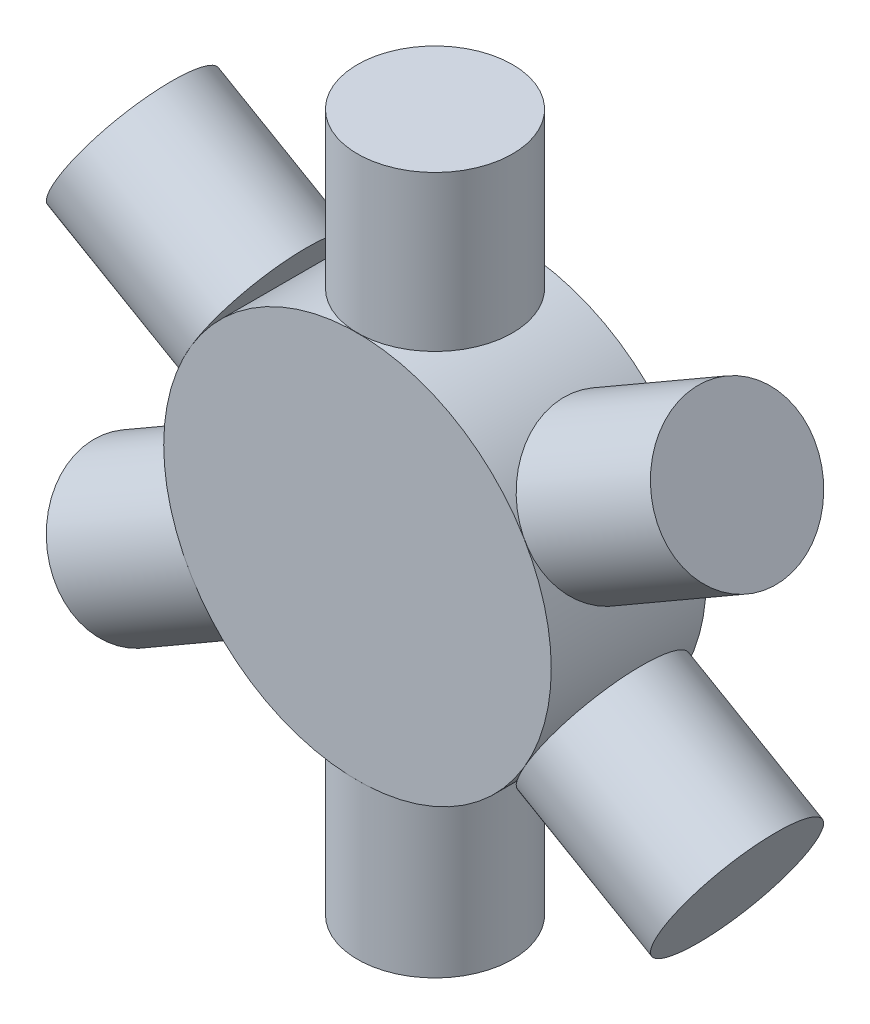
ISO-10303-21;
HEADER;
FILE_DESCRIPTION(('STEP AP214'),'2;1');
FILE_NAME('part.step','',(''),(''),'','','');
FILE_SCHEMA(('AUTOMOTIVE_DESIGN { 1 0 10303 214 1 1 1 1 }'));
ENDSEC;
DATA;
#1=APPLICATION_CONTEXT('core data for automotive mechanical design processes');
#2=APPLICATION_PROTOCOL_DEFINITION('international standard','automotive_design',2000,#1);
#3=PRODUCT_CONTEXT('',#1,'mechanical');
#4=PRODUCT('Part','Part','',(#3));
#5=PRODUCT_RELATED_PRODUCT_CATEGORY('part','',(#4));
#6=PRODUCT_DEFINITION_FORMATION('','',#4);
#7=PRODUCT_DEFINITION_CONTEXT('part definition',#1,'design');
#8=PRODUCT_DEFINITION('design','',#6,#7);
#9=PRODUCT_DEFINITION_SHAPE('','',#8);
#10=(LENGTH_UNIT() NAMED_UNIT(*) SI_UNIT(.MILLI.,.METRE.));
#11=(NAMED_UNIT(*) PLANE_ANGLE_UNIT() SI_UNIT($,.RADIAN.));
#12=(NAMED_UNIT(*) SI_UNIT($,.STERADIAN.) SOLID_ANGLE_UNIT());
#13=UNCERTAINTY_MEASURE_WITH_UNIT(LENGTH_MEASURE(1.E-05),#10,'distance_accuracy_value','');
#14=(GEOMETRIC_REPRESENTATION_CONTEXT(3) GLOBAL_UNCERTAINTY_ASSIGNED_CONTEXT((#13)) GLOBAL_UNIT_ASSIGNED_CONTEXT((#10,
#11,#12)) REPRESENTATION_CONTEXT('',''));
#15=CARTESIAN_POINT('',(0.,0.,0.));
#16=DIRECTION('',(0.,0.,1.));
#17=DIRECTION('',(1.,0.,0.));
#18=AXIS2_PLACEMENT_3D('',#15,#16,#17);
#19=CARTESIAN_POINT('',(15.5884572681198,70.9999999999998,0.));
#20=DIRECTION('',(0.866025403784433,-0.50000000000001,0.));
#21=DIRECTION('',(0.,0.,-1.));
#22=AXIS2_PLACEMENT_3D('',#19,#20,#21);
#23=CYLINDRICAL_SURFACE('',#22,4.);
#24=CARTESIAN_POINT('',(15.5884572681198,70.9999999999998,0.));
#25=DIRECTION('',(0.866025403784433,-0.50000000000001,0.));
#26=DIRECTION('',(0.,0.,-1.));
#27=AXIS2_PLACEMENT_3D('',#24,#25,#26);
#28=CIRCLE('',#27,4.);
#29=CARTESIAN_POINT('',(15.5884572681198,70.9999999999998,-4.));
#30=VERTEX_POINT('',#29);
#31=EDGE_CURVE('E46',#30,#30,#28,.T.);
#32=ORIENTED_EDGE('',*,*,#31,.F.);
#33=EDGE_LOOP('',(#32));
#34=FACE_BOUND('',#33,.T.);
#35=CARTESIAN_POINT('',(8.66025403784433,74.9999999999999,0.));
#36=DIRECTION('',(0.866025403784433,-0.50000000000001,0.));
#37=DIRECTION('',(0.,0.,-1.));
#38=AXIS2_PLACEMENT_3D('',#35,#36,#37);
#39=CIRCLE('',#38,4.);
#40=CARTESIAN_POINT('',(8.66025403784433,74.9999999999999,-4.));
#41=VERTEX_POINT('',#40);
#42=EDGE_CURVE('E11',#41,#41,#39,.T.);
#43=ORIENTED_EDGE('',*,*,#42,.T.);
#44=EDGE_LOOP('',(#43));
#45=FACE_BOUND('',#44,.T.);
#46=ADVANCED_FACE('F40',(#34,#45),#23,.T.);
#47=CARTESIAN_POINT('',(6.66025403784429,71.5358983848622,0.));
#48=DIRECTION('',(0.866025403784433,-0.50000000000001,0.));
#49=DIRECTION('',(0.,0.,-1.));
#50=AXIS2_PLACEMENT_3D('',#47,#48,#49);
#51=PLANE('',#50);
#52=ORIENTED_EDGE('',*,*,#42,.F.);
#53=EDGE_LOOP('',(#52));
#54=FACE_BOUND('',#53,.T.);
#55=ADVANCED_FACE('F55',(#54),#51,.F.);
#56=CARTESIAN_POINT('',(13.5884572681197,67.5358983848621,0.));
#57=DIRECTION('',(-0.866025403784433,0.50000000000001,0.));
#58=DIRECTION('',(0.,0.,1.));
#59=AXIS2_PLACEMENT_3D('',#56,#57,#58);
#60=PLANE('',#59);
#61=ORIENTED_EDGE('',*,*,#31,.T.);
#62=EDGE_LOOP('',(#61));
#63=FACE_BOUND('',#62,.T.);
#64=ADVANCED_FACE('F52',(#63),#60,.F.);
#65=CLOSED_SHELL('',(#46,#55,#64));
#66=MANIFOLD_SOLID_BREP('B2',#65);
#67=CARTESIAN_POINT('',(15.58845726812,88.9999999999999,0.));
#68=DIRECTION('',(0.866025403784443,0.499999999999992,0.));
#69=DIRECTION('',(0.,0.,-1.));
#70=AXIS2_PLACEMENT_3D('',#67,#68,#69);
#71=CYLINDRICAL_SURFACE('',#70,4.);
#72=CARTESIAN_POINT('',(15.58845726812,88.9999999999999,0.));
#73=DIRECTION('',(0.866025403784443,0.499999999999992,0.));
#74=DIRECTION('',(0.,0.,-1.));
#75=AXIS2_PLACEMENT_3D('',#72,#73,#74);
#76=CIRCLE('',#75,4.);
#77=CARTESIAN_POINT('',(15.58845726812,88.9999999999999,-4.));
#78=VERTEX_POINT('',#77);
#79=EDGE_CURVE('E95',#78,#78,#76,.T.);
#80=ORIENTED_EDGE('',*,*,#79,.F.);
#81=EDGE_LOOP('',(#80));
#82=FACE_BOUND('',#81,.T.);
#83=CARTESIAN_POINT('',(8.66025403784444,84.9999999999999,0.));
#84=DIRECTION('',(0.866025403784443,0.499999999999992,0.));
#85=DIRECTION('',(0.,0.,-1.));
#86=AXIS2_PLACEMENT_3D('',#83,#84,#85);
#87=CIRCLE('',#86,4.);
#88=CARTESIAN_POINT('',(8.66025403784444,84.9999999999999,-4.));
#89=VERTEX_POINT('',#88);
#90=EDGE_CURVE('E39',#89,#89,#87,.T.);
#91=ORIENTED_EDGE('',*,*,#90,.T.);
#92=EDGE_LOOP('',(#91));
#93=FACE_BOUND('',#92,.T.);
#94=ADVANCED_FACE('F89',(#82,#93),#71,.T.);
#95=CARTESIAN_POINT('',(10.6602540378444,81.5358983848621,0.));
#96=DIRECTION('',(0.866025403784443,0.499999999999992,0.));
#97=DIRECTION('',(0.,0.,-1.));
#98=AXIS2_PLACEMENT_3D('',#95,#96,#97);
#99=PLANE('',#98);
#100=ORIENTED_EDGE('',*,*,#90,.F.);
#101=EDGE_LOOP('',(#100));
#102=FACE_BOUND('',#101,.T.);
#103=ADVANCED_FACE('F104',(#102),#99,.F.);
#104=CARTESIAN_POINT('',(17.5884572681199,85.5358983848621,0.));
#105=DIRECTION('',(-0.866025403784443,-0.499999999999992,0.));
#106=DIRECTION('',(0.,0.,1.));
#107=AXIS2_PLACEMENT_3D('',#104,#105,#106);
#108=PLANE('',#107);
#109=ORIENTED_EDGE('',*,*,#79,.T.);
#110=EDGE_LOOP('',(#109));
#111=FACE_BOUND('',#110,.T.);
#112=ADVANCED_FACE('F101',(#111),#108,.F.);
#113=CLOSED_SHELL('',(#94,#103,#112));
#114=MANIFOLD_SOLID_BREP('B6',#113);
#115=CARTESIAN_POINT('',(0.,98.,0.));
#116=DIRECTION('',(0.,1.,0.));
#117=DIRECTION('',(0.,0.,-1.));
#118=AXIS2_PLACEMENT_3D('',#115,#116,#117);
#119=CYLINDRICAL_SURFACE('',#118,4.);
#120=CARTESIAN_POINT('',(0.,98.,0.));
#121=DIRECTION('',(0.,1.,0.));
#122=DIRECTION('',(0.,0.,-1.));
#123=AXIS2_PLACEMENT_3D('',#120,#121,#122);
#124=CIRCLE('',#123,4.);
#125=CARTESIAN_POINT('',(0.,98.,-4.));
#126=VERTEX_POINT('',#125);
#127=EDGE_CURVE('E144',#126,#126,#124,.T.);
#128=ORIENTED_EDGE('',*,*,#127,.F.);
#129=EDGE_LOOP('',(#128));
#130=FACE_BOUND('',#129,.T.);
#131=CARTESIAN_POINT('',(0.,90.,0.));
#132=DIRECTION('',(0.,1.,0.));
#133=DIRECTION('',(0.,0.,-1.));
#134=AXIS2_PLACEMENT_3D('',#131,#132,#133);
#135=CIRCLE('',#134,4.);
#136=CARTESIAN_POINT('',(0.,90.,-4.));
#137=VERTEX_POINT('',#136);
#138=EDGE_CURVE('E88',#137,#137,#135,.T.);
#139=ORIENTED_EDGE('',*,*,#138,.T.);
#140=EDGE_LOOP('',(#139));
#141=FACE_BOUND('',#140,.T.);
#142=ADVANCED_FACE('F138',(#130,#141),#119,.T.);
#143=CARTESIAN_POINT('',(4.,90.,0.));
#144=DIRECTION('',(0.,1.,0.));
#145=DIRECTION('',(0.,0.,-1.));
#146=AXIS2_PLACEMENT_3D('',#143,#144,#145);
#147=PLANE('',#146);
#148=ORIENTED_EDGE('',*,*,#138,.F.);
#149=EDGE_LOOP('',(#148));
#150=FACE_BOUND('',#149,.T.);
#151=ADVANCED_FACE('F153',(#150),#147,.F.);
#152=CARTESIAN_POINT('',(4.,98.,0.));
#153=DIRECTION('',(0.,-1.,0.));
#154=DIRECTION('',(0.,0.,1.));
#155=AXIS2_PLACEMENT_3D('',#152,#153,#154);
#156=PLANE('',#155);
#157=ORIENTED_EDGE('',*,*,#127,.T.);
#158=EDGE_LOOP('',(#157));
#159=FACE_BOUND('',#158,.T.);
#160=ADVANCED_FACE('F150',(#159),#156,.F.);
#161=CLOSED_SHELL('',(#142,#151,#160));
#162=MANIFOLD_SOLID_BREP('B34',#161);
#163=CARTESIAN_POINT('',(-15.5884572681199,89.0000000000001,0.));
#164=DIRECTION('',(-0.866025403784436,0.500000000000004,0.));
#165=DIRECTION('',(0.,0.,-1.));
#166=AXIS2_PLACEMENT_3D('',#163,#164,#165);
#167=CYLINDRICAL_SURFACE('',#166,4.);
#168=CARTESIAN_POINT('',(-15.5884572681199,89.0000000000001,0.));
#169=DIRECTION('',(-0.866025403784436,0.500000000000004,0.));
#170=DIRECTION('',(0.,0.,-1.));
#171=AXIS2_PLACEMENT_3D('',#168,#169,#170);
#172=CIRCLE('',#171,4.);
#173=CARTESIAN_POINT('',(-15.5884572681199,89.0000000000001,-4.));
#174=VERTEX_POINT('',#173);
#175=EDGE_CURVE('E193',#174,#174,#172,.T.);
#176=ORIENTED_EDGE('',*,*,#175,.F.);
#177=EDGE_LOOP('',(#176));
#178=FACE_BOUND('',#177,.T.);
#179=CARTESIAN_POINT('',(-8.66025403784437,85.,0.));
#180=DIRECTION('',(-0.866025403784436,0.500000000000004,0.));
#181=DIRECTION('',(0.,0.,-1.));
#182=AXIS2_PLACEMENT_3D('',#179,#180,#181);
#183=CIRCLE('',#182,4.);
#184=CARTESIAN_POINT('',(-8.66025403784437,85.,-4.));
#185=VERTEX_POINT('',#184);
#186=EDGE_CURVE('E137',#185,#185,#183,.T.);
#187=ORIENTED_EDGE('',*,*,#186,.T.);
#188=EDGE_LOOP('',(#187));
#189=FACE_BOUND('',#188,.T.);
#190=ADVANCED_FACE('F187',(#178,#189),#167,.T.);
#191=CARTESIAN_POINT('',(-6.66025403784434,88.4641016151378,0.));
#192=DIRECTION('',(-0.866025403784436,0.500000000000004,0.));
#193=DIRECTION('',(0.,0.,-1.));
#194=AXIS2_PLACEMENT_3D('',#191,#192,#193);
#195=PLANE('',#194);
#196=ORIENTED_EDGE('',*,*,#186,.F.);
#197=EDGE_LOOP('',(#196));
#198=FACE_BOUND('',#197,.T.);
#199=ADVANCED_FACE('F202',(#198),#195,.F.);
#200=CARTESIAN_POINT('',(-13.5884572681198,92.4641016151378,0.));
#201=DIRECTION('',(0.866025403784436,-0.500000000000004,0.));
#202=DIRECTION('',(0.,0.,1.));
#203=AXIS2_PLACEMENT_3D('',#200,#201,#202);
#204=PLANE('',#203);
#205=ORIENTED_EDGE('',*,*,#175,.T.);
#206=EDGE_LOOP('',(#205));
#207=FACE_BOUND('',#206,.T.);
#208=ADVANCED_FACE('F199',(#207),#204,.F.);
#209=CLOSED_SHELL('',(#190,#199,#208));
#210=MANIFOLD_SOLID_BREP('B83',#209);
#211=CARTESIAN_POINT('',(-15.5884572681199,71.,0.));
#212=DIRECTION('',(-0.86602540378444,-0.499999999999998,0.));
#213=DIRECTION('',(0.,0.,-1.));
#214=AXIS2_PLACEMENT_3D('',#211,#212,#213);
#215=CYLINDRICAL_SURFACE('',#214,4.);
#216=CARTESIAN_POINT('',(-15.5884572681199,71.,0.));
#217=DIRECTION('',(-0.86602540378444,-0.499999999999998,0.));
#218=DIRECTION('',(0.,0.,-1.));
#219=AXIS2_PLACEMENT_3D('',#216,#217,#218);
#220=CIRCLE('',#219,4.);
#221=CARTESIAN_POINT('',(-15.5884572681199,71.,-4.));
#222=VERTEX_POINT('',#221);
#223=EDGE_CURVE('E242',#222,#222,#220,.T.);
#224=ORIENTED_EDGE('',*,*,#223,.F.);
#225=EDGE_LOOP('',(#224));
#226=FACE_BOUND('',#225,.T.);
#227=CARTESIAN_POINT('',(-8.66025403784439,75.,0.));
#228=DIRECTION('',(-0.86602540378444,-0.499999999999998,0.));
#229=DIRECTION('',(0.,0.,-1.));
#230=AXIS2_PLACEMENT_3D('',#227,#228,#229);
#231=CIRCLE('',#230,4.);
#232=CARTESIAN_POINT('',(-8.66025403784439,75.,-4.));
#233=VERTEX_POINT('',#232);
#234=EDGE_CURVE('E186',#233,#233,#231,.T.);
#235=ORIENTED_EDGE('',*,*,#234,.T.);
#236=EDGE_LOOP('',(#235));
#237=FACE_BOUND('',#236,.T.);
#238=ADVANCED_FACE('F236',(#226,#237),#215,.T.);
#239=CARTESIAN_POINT('',(-10.6602540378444,78.4641016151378,0.));
#240=DIRECTION('',(-0.86602540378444,-0.499999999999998,0.));
#241=DIRECTION('',(0.,0.,-1.));
#242=AXIS2_PLACEMENT_3D('',#239,#240,#241);
#243=PLANE('',#242);
#244=ORIENTED_EDGE('',*,*,#234,.F.);
#245=EDGE_LOOP('',(#244));
#246=FACE_BOUND('',#245,.T.);
#247=ADVANCED_FACE('F251',(#246),#243,.F.);
#248=CARTESIAN_POINT('',(-17.5884572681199,74.4641016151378,0.));
#249=DIRECTION('',(0.86602540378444,0.499999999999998,0.));
#250=DIRECTION('',(0.,0.,1.));
#251=AXIS2_PLACEMENT_3D('',#248,#249,#250);
#252=PLANE('',#251);
#253=ORIENTED_EDGE('',*,*,#223,.T.);
#254=EDGE_LOOP('',(#253));
#255=FACE_BOUND('',#254,.T.);
#256=ADVANCED_FACE('F248',(#255),#252,.F.);
#257=CLOSED_SHELL('',(#238,#247,#256));
#258=MANIFOLD_SOLID_BREP('B132',#257);
#259=CARTESIAN_POINT('',(0.,62.,0.));
#260=DIRECTION('',(0.,-1.,0.));
#261=DIRECTION('',(0.,0.,-1.));
#262=AXIS2_PLACEMENT_3D('',#259,#260,#261);
#263=CYLINDRICAL_SURFACE('',#262,4.);
#264=CARTESIAN_POINT('',(0.,62.,0.));
#265=DIRECTION('',(0.,-1.,0.));
#266=DIRECTION('',(0.,0.,-1.));
#267=AXIS2_PLACEMENT_3D('',#264,#265,#266);
#268=CIRCLE('',#267,4.);
#269=CARTESIAN_POINT('',(0.,62.,-4.));
#270=VERTEX_POINT('',#269);
#271=EDGE_CURVE('E290',#270,#270,#268,.T.);
#272=ORIENTED_EDGE('',*,*,#271,.F.);
#273=EDGE_LOOP('',(#272));
#274=FACE_BOUND('',#273,.T.);
#275=CARTESIAN_POINT('',(0.,70.,0.));
#276=DIRECTION('',(0.,-1.,0.));
#277=DIRECTION('',(0.,0.,-1.));
#278=AXIS2_PLACEMENT_3D('',#275,#276,#277);
#279=CIRCLE('',#278,4.);
#280=CARTESIAN_POINT('',(0.,70.,-4.));
#281=VERTEX_POINT('',#280);
#282=EDGE_CURVE('E235',#281,#281,#279,.T.);
#283=ORIENTED_EDGE('',*,*,#282,.T.);
#284=EDGE_LOOP('',(#283));
#285=FACE_BOUND('',#284,.T.);
#286=ADVANCED_FACE('F284',(#274,#285),#263,.T.);
#287=CARTESIAN_POINT('',(-4.,70.,0.));
#288=DIRECTION('',(0.,-1.,0.));
#289=DIRECTION('',(0.,0.,-1.));
#290=AXIS2_PLACEMENT_3D('',#287,#288,#289);
#291=PLANE('',#290);
#292=ORIENTED_EDGE('',*,*,#282,.F.);
#293=EDGE_LOOP('',(#292));
#294=FACE_BOUND('',#293,.T.);
#295=ADVANCED_FACE('F299',(#294),#291,.F.);
#296=CARTESIAN_POINT('',(-4.,62.,0.));
#297=DIRECTION('',(0.,1.,0.));
#298=DIRECTION('',(0.,0.,1.));
#299=AXIS2_PLACEMENT_3D('',#296,#297,#298);
#300=PLANE('',#299);
#301=ORIENTED_EDGE('',*,*,#271,.T.);
#302=EDGE_LOOP('',(#301));
#303=FACE_BOUND('',#302,.T.);
#304=ADVANCED_FACE('F296',(#303),#300,.F.);
#305=CLOSED_SHELL('',(#286,#295,#304));
#306=MANIFOLD_SOLID_BREP('B181',#305);
#307=CARTESIAN_POINT('',(0.,80.,4.));
#308=DIRECTION('',(0.,0.,-1.));
#309=DIRECTION('',(-1.,0.,0.));
#310=AXIS2_PLACEMENT_3D('',#307,#308,#309);
#311=CYLINDRICAL_SURFACE('',#310,10.);
#312=CARTESIAN_POINT('',(0.,80.,4.));
#313=DIRECTION('',(0.,0.,1.));
#314=DIRECTION('',(1.,0.,0.));
#315=AXIS2_PLACEMENT_3D('',#312,#313,#314);
#316=CIRCLE('',#315,10.);
#317=CARTESIAN_POINT('',(10.,80.,4.));
#318=VERTEX_POINT('',#317);
#319=EDGE_CURVE('E283',#318,#318,#316,.T.);
#320=ORIENTED_EDGE('',*,*,#319,.F.);
#321=EDGE_LOOP('',(#320));
#322=FACE_BOUND('',#321,.T.);
#323=CARTESIAN_POINT('',(0.,80.,-4.));
#324=DIRECTION('',(0.,0.,1.));
#325=DIRECTION('',(1.,0.,0.));
#326=AXIS2_PLACEMENT_3D('',#323,#324,#325);
#327=CIRCLE('',#326,10.);
#328=CARTESIAN_POINT('',(10.,80.,-4.));
#329=VERTEX_POINT('',#328);
#330=EDGE_CURVE('E328',#329,#329,#327,.T.);
#331=ORIENTED_EDGE('',*,*,#330,.T.);
#332=EDGE_LOOP('',(#331));
#333=FACE_BOUND('',#332,.T.);
#334=ADVANCED_FACE('F325',(#322,#333),#311,.T.);
#335=CARTESIAN_POINT('',(0.,80.,4.));
#336=DIRECTION('',(0.,0.,1.));
#337=DIRECTION('',(1.,0.,0.));
#338=AXIS2_PLACEMENT_3D('',#335,#336,#337);
#339=PLANE('',#338);
#340=ORIENTED_EDGE('',*,*,#319,.T.);
#341=EDGE_LOOP('',(#340));
#342=FACE_BOUND('',#341,.T.);
#343=ADVANCED_FACE('F340',(#342),#339,.T.);
#344=CARTESIAN_POINT('',(0.,80.,-4.));
#345=DIRECTION('',(0.,0.,1.));
#346=DIRECTION('',(1.,0.,0.));
#347=AXIS2_PLACEMENT_3D('',#344,#345,#346);
#348=PLANE('',#347);
#349=ORIENTED_EDGE('',*,*,#330,.F.);
#350=EDGE_LOOP('',(#349));
#351=FACE_BOUND('',#350,.T.);
#352=ADVANCED_FACE('F338',(#351),#348,.F.);
#353=CLOSED_SHELL('',(#334,#343,#352));
#354=MANIFOLD_SOLID_BREP('B230',#353);
#355=ADVANCED_BREP_SHAPE_REPRESENTATION('',(#18,#66,#114,#162,#210,#258,#306,#354),#14);
#356=SHAPE_DEFINITION_REPRESENTATION(#9,#355);
ENDSEC;
END-ISO-10303-21;
